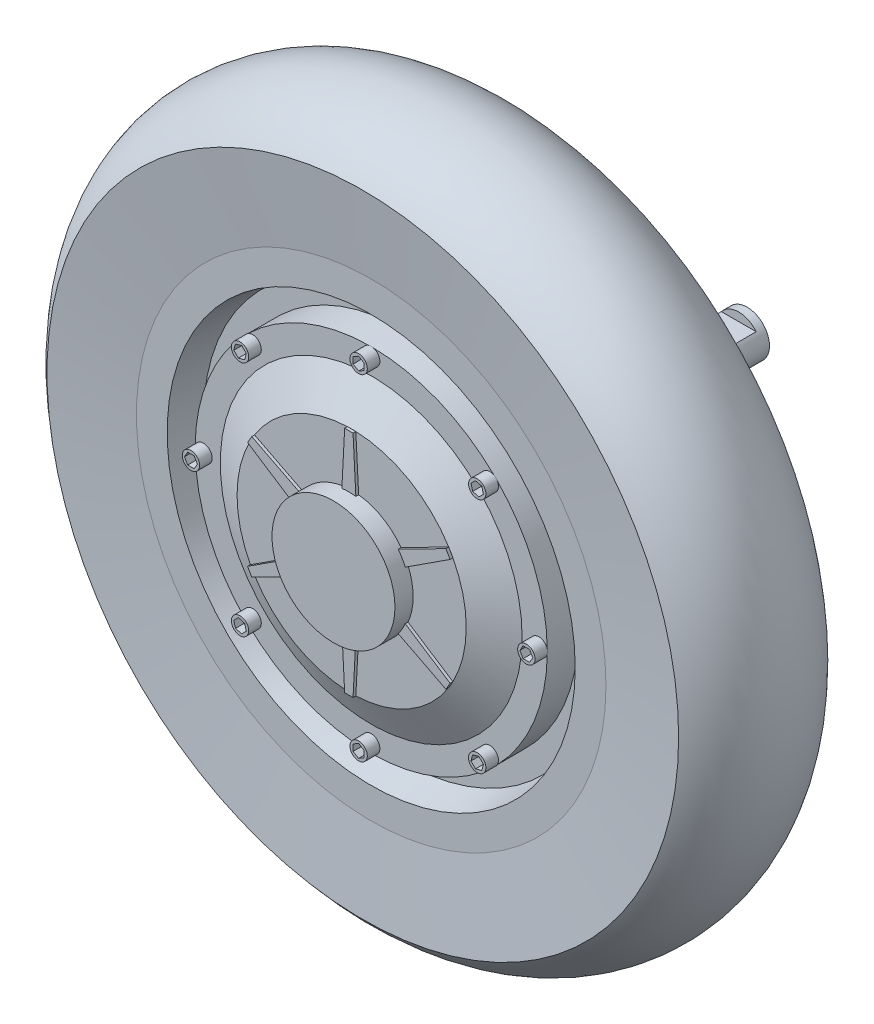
from build123d import *

# Parameters (mm, degrees)
ENL_V_START                  = -3
ESQUISSE2_W                  = 12.489995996
ESQUISSE2_H                  = 3
ENL_V_MAT_EXTRU_1_DEPTH      = 44
ESQUISSE3_W                  = 8.5
ESQUISSE3_H                  = 21
BOSS_EXTRU_1_START           = -62
BOSS_EXTRU_1_DEPTH           = 63
R_P_TITION_CIRCULAIRE1_COUNT = 6
ESQUISSE5_R                  = 3.1
BOSS_EXTRU_2_DEPTH           = 4.5
ENL_V_MAT_EXTRU_2_DEPTH      = 3
R_P_TITION_CIRCULAIRE2_COUNT = 8


with BuildPart() as part:
    # Esquisse1 → R_volution1 (revolve)
    with BuildSketch(Plane(origin=(0, 0, 0), x_dir=(0, 0, -1), z_dir=(1, 0, 0)), mode=Mode.PRIVATE) as r_volution1_sk:
        with BuildLine():
            Line((87.5, 0), (-47, 0))
            Line((-47, 0), (-60.5, 0))
            Line((-60.5, 0), (-60.5, 22))
            Line((-60.5, 22), (-54, 22))
            Line((-54, 22), (-54, 41))
            Line((-54, 41), (-47, 54))
            Line((-47, 54), (-47, 63))
            Line((-47, 63), (-36, 63))
            Line((-36, 63), (-36, 71))
            Line((-36, 71), (-47, 73))
            Line((-47, 73), (-47, 84))
            Line((-47, 84), (-50, 113))
            ThreePointArc((-50, 113), (-23.5, 126), (3, 113))
            Line((3, 113), (0, 84))
            Line((0, 84), (0, 73))
            Line((0, 73), (-11, 71))
            Line((-11, 71), (-11, 63))
            Line((-11, 63), (0, 63))
            Line((0, 63), (0, 54))
            Line((0, 54), (7, 41))
            Line((7, 41), (7, 22))
            Line((7, 22), (13.5, 22))
            Line((13.5, 22), (13.5, 8))
            Line((13.5, 8), (87.5, 8))
            Line((87.5, 8), (87.5, 0))
        make_face()
    revolve(r_volution1_sk.sketch.rotate(Axis((0, 0, 0), (0, 0, -1)), 90), axis=Axis((0, 0, 0), (0, 0, -1)))

    # Esquisse2 → Enl_v. mat.-Extru.1 (cut)
    with BuildSketch(Plane(origin=(0, 0, -87.5), x_dir=(-1, 0, 0), z_dir=(0, 0, -1)).offset(ENL_V_START)):
        with Locations((0, 6.5)):
            Rectangle(ESQUISSE2_W, ESQUISSE2_H)
    extrude(amount=-ENL_V_MAT_EXTRU_1_DEPTH, mode=Mode.SUBTRACT)

    # Esquisse3 → R_volution2 (revolve)
    with BuildSketch(Plane(origin=(0, 0, 0), x_dir=(1, 0, 0), z_dir=(0, 1, 0)), mode=Mode.PRIVATE) as r_volution2_sk:
        with Locations((-4.25, 24)):
            Rectangle(ESQUISSE3_W, ESQUISSE3_H)
    revolve(r_volution2_sk.sketch.rotate(Axis((0, 0, 0), (0, 0, -1)), 180), axis=Axis((0, 0, 0), (0, 0, -1)))

    # Esquisse4 → Boss.-Extru.1 (add)
    with BuildSketch(Plane.XY.offset(54).offset(BOSS_EXTRU_1_START)):
        Polygon((-1.5, 40.972551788), (1.5, 40.972551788), (2.5, 21.857492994), (-2.5, 21.857492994), align=None)
    boss_extru_1 = extrude(amount=BOSS_EXTRU_1_DEPTH)

    # R_p_tition circulaire1: Boss.-Extru.1 ×6 about axis
    r_p_tition_circulaire1_axis = Axis((0, 0, 0), (0, 0, 1))
    for i in range(1, R_P_TITION_CIRCULAIRE1_COUNT):
        add(boss_extru_1.rotate(r_p_tition_circulaire1_axis, i * 360 / R_P_TITION_CIRCULAIRE1_COUNT))

    # Esquisse5 → Boss.-Extru.2 (add)
    with BuildSketch(Plane.XY.offset(47)):
        with Locations(Location((0, 60, 0), (0, 0, 104.960916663))):
            Circle(ESQUISSE5_R)
    boss_extru_2 = extrude(amount=BOSS_EXTRU_2_DEPTH)

    # Esquisse6 → Enl_v. mat.-Extru.2 (cut)
    with BuildSketch(Plane.XY.offset(51.5)):
        Polygon((2, 58.845299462), (2, 61.154700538), (0, 62.309401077), (-2, 61.154700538), (-2, 58.845299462), (0, 57.690598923), align=None)
    enl_v_mat_extru_2 = extrude(amount=-ENL_V_MAT_EXTRU_2_DEPTH, mode=Mode.SUBTRACT)

    # R_p_tition circulaire2: Boss.-Extru.2, Enl_v. mat.-Extru.2 ×8 about axis
    r_p_tition_circulaire2_axis = Axis((0, 0, 0), (0, 0, 1))
    add([boss_extru_2.rotate(r_p_tition_circulaire2_axis, i * 360 / R_P_TITION_CIRCULAIRE2_COUNT) for i in range(1, R_P_TITION_CIRCULAIRE2_COUNT)])
    add([enl_v_mat_extru_2.rotate(r_p_tition_circulaire2_axis, i * 360 / R_P_TITION_CIRCULAIRE2_COUNT) for i in range(1, R_P_TITION_CIRCULAIRE2_COUNT)], mode=Mode.SUBTRACT)


solid = part.part
